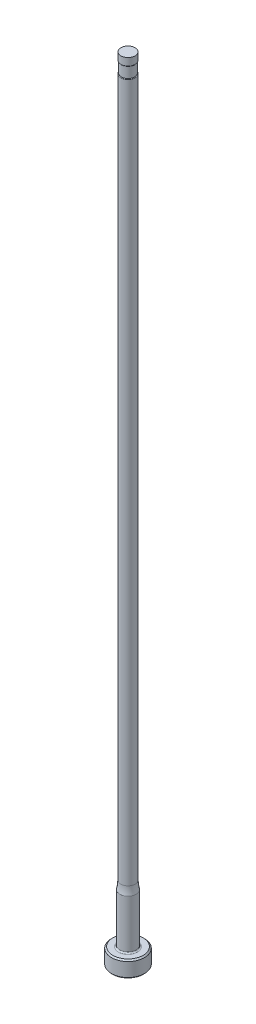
ISO-10303-21;
HEADER;
FILE_DESCRIPTION(('STEP AP214'),'2;1');
FILE_NAME('part.step','',(''),(''),'','','');
FILE_SCHEMA(('AUTOMOTIVE_DESIGN { 1 0 10303 214 1 1 1 1 }'));
ENDSEC;
DATA;
#1=APPLICATION_CONTEXT('core data for automotive mechanical design processes');
#2=APPLICATION_PROTOCOL_DEFINITION('international standard','automotive_design',2000,#1);
#3=PRODUCT_CONTEXT('',#1,'mechanical');
#4=PRODUCT('Part','Part','',(#3));
#5=PRODUCT_RELATED_PRODUCT_CATEGORY('part','',(#4));
#6=PRODUCT_DEFINITION_FORMATION('','',#4);
#7=PRODUCT_DEFINITION_CONTEXT('part definition',#1,'design');
#8=PRODUCT_DEFINITION('design','',#6,#7);
#9=PRODUCT_DEFINITION_SHAPE('','',#8);
#10=(LENGTH_UNIT() NAMED_UNIT(*) SI_UNIT(.MILLI.,.METRE.));
#11=(NAMED_UNIT(*) PLANE_ANGLE_UNIT() SI_UNIT($,.RADIAN.));
#12=(NAMED_UNIT(*) SI_UNIT($,.STERADIAN.) SOLID_ANGLE_UNIT());
#13=UNCERTAINTY_MEASURE_WITH_UNIT(LENGTH_MEASURE(1.E-05),#10,'distance_accuracy_value','');
#14=(GEOMETRIC_REPRESENTATION_CONTEXT(3) GLOBAL_UNCERTAINTY_ASSIGNED_CONTEXT((#13)) GLOBAL_UNIT_ASSIGNED_CONTEXT((#10,
#11,#12)) REPRESENTATION_CONTEXT('',''));
#15=CARTESIAN_POINT('',(0.,0.,0.));
#16=DIRECTION('',(0.,0.,1.));
#17=DIRECTION('',(1.,0.,0.));
#18=AXIS2_PLACEMENT_3D('',#15,#16,#17);
#19=CARTESIAN_POINT('',(0.,259.958771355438,0.));
#20=DIRECTION('',(0.,1.,0.));
#21=DIRECTION('',(0.,0.,1.));
#22=AXIS2_PLACEMENT_3D('',#19,#20,#21);
#23=CYLINDRICAL_SURFACE('',#22,1.38810999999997);
#24=DIRECTION('',(0.,1.,0.));
#25=VECTOR('',#24,1.);
#26=CARTESIAN_POINT('',(-1.28650999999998,259.958771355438,-0.521288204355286));
#27=LINE('',#26,#25);
#28=CARTESIAN_POINT('',(-1.28650999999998,148.719565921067,-0.521288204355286));
#29=VERTEX_POINT('',#28);
#30=CARTESIAN_POINT('',(-1.28650999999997,111.76,-0.521288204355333));
#31=VERTEX_POINT('',#30);
#32=EDGE_CURVE('E66',#29,#31,#27,.F.);
#33=ORIENTED_EDGE('',*,*,#32,.F.);
#34=CARTESIAN_POINT('',(0.,148.719565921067,0.));
#35=DIRECTION('',(0.,1.,0.));
#36=DIRECTION('',(0.,0.,1.));
#37=AXIS2_PLACEMENT_3D('',#34,#35,#36);
#38=CIRCLE('',#37,1.38810999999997);
#39=CARTESIAN_POINT('',(-1.28650999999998,148.719565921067,0.521288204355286));
#40=VERTEX_POINT('',#39);
#41=EDGE_CURVE('E44',#29,#40,#38,.F.);
#42=ORIENTED_EDGE('',*,*,#41,.T.);
#43=DIRECTION('',(0.,1.,0.));
#44=VECTOR('',#43,1.);
#45=CARTESIAN_POINT('',(-1.28650999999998,259.958771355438,0.521288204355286));
#46=LINE('',#45,#44);
#47=CARTESIAN_POINT('',(-1.28650999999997,111.76,0.521288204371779));
#48=VERTEX_POINT('',#47);
#49=EDGE_CURVE('E72',#48,#40,#46,.T.);
#50=ORIENTED_EDGE('',*,*,#49,.F.);
#51=CARTESIAN_POINT('',(-1.28650999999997,111.76,-0.521288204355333));
#52=CARTESIAN_POINT('',(-1.28650942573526,111.734928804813,-0.521284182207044));
#53=CARTESIAN_POINT('',(-1.28680726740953,111.709865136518,-0.520555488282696));
#54=CARTESIAN_POINT('',(-1.28799191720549,111.659826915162,-0.517619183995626));
#55=CARTESIAN_POINT('',(-1.28887900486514,111.634852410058,-0.515410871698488));
#56=CARTESIAN_POINT('',(-1.29243982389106,111.559619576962,-0.506452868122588));
#57=CARTESIAN_POINT('',(-1.29601290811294,111.509650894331,-0.49736839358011));
#58=CARTESIAN_POINT('',(-1.30530992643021,111.411479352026,-0.472434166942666));
#59=CARTESIAN_POINT('',(-1.31103961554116,111.363281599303,-0.456566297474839));
#60=CARTESIAN_POINT('',(-1.32412375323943,111.270513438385,-0.417110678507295));
#61=CARTESIAN_POINT('',(-1.33146964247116,111.225925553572,-0.393563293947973));
#62=CARTESIAN_POINT('',(-1.34350828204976,111.160593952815,-0.349438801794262));
#63=CARTESIAN_POINT('',(-1.34799903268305,111.137780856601,-0.331865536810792));
#64=CARTESIAN_POINT('',(-1.35686421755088,111.09496367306,-0.293524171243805));
#65=CARTESIAN_POINT('',(-1.36123876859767,111.074956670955,-0.272759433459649));
#66=CARTESIAN_POINT('',(-1.36869665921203,111.042112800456,-0.23208499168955));
#67=CARTESIAN_POINT('',(-1.37186978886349,111.028633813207,-0.212714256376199));
#68=CARTESIAN_POINT('',(-1.37757131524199,111.00495318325,-0.171955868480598));
#69=CARTESIAN_POINT('',(-1.38010004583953,110.994749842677,-0.150569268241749));
#70=CARTESIAN_POINT('',(-1.38424028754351,110.978264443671,-0.105984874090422));
#71=CARTESIAN_POINT('',(-1.38584269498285,110.972021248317,-0.0827715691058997));
#72=CARTESIAN_POINT('',(-1.3878558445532,110.964203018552,-0.0355242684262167));
#73=CARTESIAN_POINT('',(-1.38826785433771,110.962623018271,-0.0114911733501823));
#74=CARTESIAN_POINT('',(-1.38787374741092,110.964145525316,0.0326639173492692));
#75=CARTESIAN_POINT('',(-1.38724652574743,110.966560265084,0.0528147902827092));
#76=CARTESIAN_POINT('',(-1.38517272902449,110.974639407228,0.0924056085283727));
#77=CARTESIAN_POINT('',(-1.38372605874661,110.980304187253,0.111845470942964));
#78=CARTESIAN_POINT('',(-1.38015682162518,110.994532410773,0.149590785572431));
#79=CARTESIAN_POINT('',(-1.37803307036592,111.003100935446,0.167894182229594));
#80=CARTESIAN_POINT('',(-1.37329208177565,111.022682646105,0.203060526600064));
#81=CARTESIAN_POINT('',(-1.3706746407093,111.033696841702,0.219922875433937));
#82=CARTESIAN_POINT('',(-1.36363743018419,111.064179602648,0.260714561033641));
#83=CARTESIAN_POINT('',(-1.35900359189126,111.085015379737,0.283587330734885));
#84=CARTESIAN_POINT('',(-1.34954115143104,111.130071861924,0.325660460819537));
#85=CARTESIAN_POINT('',(-1.34471211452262,111.154300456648,0.344852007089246));
#86=CARTESIAN_POINT('',(-1.3331073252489,111.216742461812,0.387781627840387));
#87=CARTESIAN_POINT('',(-1.32644843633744,111.256293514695,0.409600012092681));
#88=CARTESIAN_POINT('',(-1.31433631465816,111.338492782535,0.446935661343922));
#89=CARTESIAN_POINT('',(-1.3088875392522,111.381151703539,0.462429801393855));
#90=CARTESIAN_POINT('',(-1.29848168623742,111.479173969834,0.491004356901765));
#91=CARTESIAN_POINT('',(-1.29398787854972,111.535047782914,0.50251359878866));
#92=CARTESIAN_POINT('',(-1.2895011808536,111.619377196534,0.513856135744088));
#93=CARTESIAN_POINT('',(-1.28838136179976,111.647428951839,0.516650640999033));
#94=CARTESIAN_POINT('',(-1.28688584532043,111.703649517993,0.520362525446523));
#95=CARTESIAN_POINT('',(-1.28650943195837,111.731818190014,0.521281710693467));
#96=CARTESIAN_POINT('',(-1.28650999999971,111.759999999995,0.521288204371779));
#97=B_SPLINE_CURVE_WITH_KNOTS('',3,(#51,#52,#53,#54,#55,#56,#57,#58,#59,#60,#61,#62,#63,#64,#65,
#66,#67,#68,#69,#70,#71,#72,#73,#74,#75,#76,#77,#78,#79,#80,#81,#82,#83,#84,#85,#86,#87,#88,#89,
#90,#91,#92,#93,#94,#95,#96),.UNSPECIFIED.,.F.,.F.,(4,2,2,2,2,2,2,2,2,2,2,2,2,2,2,2,2,2,2,2,2,2,
4),(0.,0.0751855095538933,0.15040671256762,0.30263293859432,0.455268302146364,0.607113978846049,
0.694309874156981,0.781414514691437,0.852578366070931,0.923705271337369,0.995519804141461,
1.06725783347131,1.12787752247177,1.18850425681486,1.2492376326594,1.30999612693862,
1.40332110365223,1.49686681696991,1.63308593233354,1.76979877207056,1.94068119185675,
2.02526314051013,2.10976359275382),.UNSPECIFIED.);
#98=EDGE_CURVE('E74',#31,#48,#97,.T.);
#99=ORIENTED_EDGE('',*,*,#98,.F.);
#100=EDGE_LOOP('',(#33,#42,#50,#99));
#101=FACE_BOUND('',#100,.T.);
#102=CARTESIAN_POINT('',(0.,14.2787642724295,0.));
#103=DIRECTION('',(0.,1.,0.));
#104=DIRECTION('',(0.,0.,1.));
#105=AXIS2_PLACEMENT_3D('',#102,#103,#104);
#106=CIRCLE('',#105,1.38810999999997);
#107=CARTESIAN_POINT('',(0.,14.2787642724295,1.38810999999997));
#108=VERTEX_POINT('',#107);
#109=EDGE_CURVE('E95',#108,#108,#106,.T.);
#110=ORIENTED_EDGE('',*,*,#109,.T.);
#111=EDGE_LOOP('',(#110));
#112=FACE_BOUND('',#111,.T.);
#113=ADVANCED_FACE('F36',(#101,#112),#23,.T.);
#114=CARTESIAN_POINT('',(0.,14.2787642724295,0.));
#115=DIRECTION('',(0.,1.,0.));
#116=DIRECTION('',(0.,0.,1.));
#117=AXIS2_PLACEMENT_3D('',#114,#115,#116);
#118=TOROIDAL_SURFACE('',#117,7.73810999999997,6.35);
#119=CARTESIAN_POINT('',(0.,12.7,0.));
#120=DIRECTION('',(0.,1.,0.));
#121=DIRECTION('',(0.,0.,1.));
#122=AXIS2_PLACEMENT_3D('',#119,#120,#121);
#123=CIRCLE('',#122,1.58749999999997);
#124=CARTESIAN_POINT('',(0.,12.7,1.58749999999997));
#125=VERTEX_POINT('',#124);
#126=EDGE_CURVE('E92',#125,#125,#123,.T.);
#127=ORIENTED_EDGE('',*,*,#126,.T.);
#128=EDGE_LOOP('',(#127));
#129=FACE_BOUND('',#128,.T.);
#130=ORIENTED_EDGE('',*,*,#109,.F.);
#131=EDGE_LOOP('',(#130));
#132=FACE_BOUND('',#131,.T.);
#133=ADVANCED_FACE('F156',(#129,#132),#118,.F.);
#134=CARTESIAN_POINT('',(0.,259.958771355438,0.));
#135=DIRECTION('',(0.,1.,0.));
#136=DIRECTION('',(0.,0.,1.));
#137=AXIS2_PLACEMENT_3D('',#134,#135,#136);
#138=CYLINDRICAL_SURFACE('',#137,1.58749999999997);
#139=CARTESIAN_POINT('',(0.,3.42900000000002,0.));
#140=DIRECTION('',(0.,1.,0.));
#141=DIRECTION('',(0.,0.,1.));
#142=AXIS2_PLACEMENT_3D('',#139,#140,#141);
#143=CIRCLE('',#142,1.58749999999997);
#144=CARTESIAN_POINT('',(0.,3.42900000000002,1.58749999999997));
#145=VERTEX_POINT('',#144);
#146=EDGE_CURVE('E110',#145,#145,#143,.T.);
#147=ORIENTED_EDGE('',*,*,#146,.T.);
#148=EDGE_LOOP('',(#147));
#149=FACE_BOUND('',#148,.T.);
#150=ORIENTED_EDGE('',*,*,#126,.F.);
#151=EDGE_LOOP('',(#150));
#152=FACE_BOUND('',#151,.T.);
#153=ADVANCED_FACE('F153',(#149,#152),#138,.T.);
#154=CARTESIAN_POINT('',(-3.17499999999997,3.175,0.));
#155=DIRECTION('',(0.,1.,0.));
#156=DIRECTION('',(0.,0.,1.));
#157=AXIS2_PLACEMENT_3D('',#154,#155,#156);
#158=PLANE('',#157);
#159=CARTESIAN_POINT('',(0.,3.175,0.));
#160=DIRECTION('',(0.,1.,0.));
#161=DIRECTION('',(0.,0.,1.));
#162=AXIS2_PLACEMENT_3D('',#159,#160,#161);
#163=CIRCLE('',#162,1.84149999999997);
#164=CARTESIAN_POINT('',(0.,3.175,1.84149999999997));
#165=VERTEX_POINT('',#164);
#166=EDGE_CURVE('E78',#165,#165,#163,.F.);
#167=ORIENTED_EDGE('',*,*,#166,.T.);
#168=EDGE_LOOP('',(#167));
#169=FACE_BOUND('',#168,.T.);
#170=CARTESIAN_POINT('',(0.,3.175,0.));
#171=DIRECTION('',(0.,1.,0.));
#172=DIRECTION('',(0.,0.,1.));
#173=AXIS2_PLACEMENT_3D('',#170,#171,#172);
#174=CIRCLE('',#173,2.92099999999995);
#175=CARTESIAN_POINT('',(0.,3.175,2.92099999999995));
#176=VERTEX_POINT('',#175);
#177=EDGE_CURVE('E98',#176,#176,#174,.T.);
#178=ORIENTED_EDGE('',*,*,#177,.T.);
#179=EDGE_LOOP('',(#178));
#180=FACE_BOUND('',#179,.T.);
#181=ADVANCED_FACE('F149',(#169,#180),#158,.T.);
#182=CARTESIAN_POINT('',(0.,259.958771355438,0.));
#183=DIRECTION('',(0.,1.,0.));
#184=DIRECTION('',(0.,0.,1.));
#185=AXIS2_PLACEMENT_3D('',#182,#183,#184);
#186=CYLINDRICAL_SURFACE('',#185,3.17499999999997);
#187=CARTESIAN_POINT('',(0.,2.92100000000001,0.));
#188=DIRECTION('',(0.,1.,0.));
#189=DIRECTION('',(0.,0.,1.));
#190=AXIS2_PLACEMENT_3D('',#187,#188,#189);
#191=CIRCLE('',#190,3.17499999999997);
#192=CARTESIAN_POINT('',(0.,2.92100000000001,3.17499999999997));
#193=VERTEX_POINT('',#192);
#194=EDGE_CURVE('E104',#193,#193,#191,.F.);
#195=ORIENTED_EDGE('',*,*,#194,.T.);
#196=EDGE_LOOP('',(#195));
#197=FACE_BOUND('',#196,.T.);
#198=CARTESIAN_POINT('',(0.,0.254000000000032,0.));
#199=DIRECTION('',(0.,-1.,0.));
#200=DIRECTION('',(0.,0.,-1.));
#201=AXIS2_PLACEMENT_3D('',#198,#199,#200);
#202=CIRCLE('',#201,3.17499999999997);
#203=CARTESIAN_POINT('',(0.,0.254000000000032,-3.17499999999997));
#204=VERTEX_POINT('',#203);
#205=EDGE_CURVE('E101',#204,#204,#202,.F.);
#206=ORIENTED_EDGE('',*,*,#205,.T.);
#207=EDGE_LOOP('',(#206));
#208=FACE_BOUND('',#207,.T.);
#209=ADVANCED_FACE('F145',(#197,#208),#186,.T.);
#210=CARTESIAN_POINT('',(0.,0.,0.));
#211=DIRECTION('',(0.,-1.,0.));
#212=DIRECTION('',(0.,0.,-1.));
#213=AXIS2_PLACEMENT_3D('',#210,#211,#212);
#214=PLANE('',#213);
#215=CARTESIAN_POINT('',(0.,0.,0.));
#216=DIRECTION('',(0.,-1.,0.));
#217=DIRECTION('',(0.,0.,-1.));
#218=AXIS2_PLACEMENT_3D('',#215,#216,#217);
#219=CIRCLE('',#218,2.92099999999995);
#220=CARTESIAN_POINT('',(0.,0.,-2.92099999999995));
#221=VERTEX_POINT('',#220);
#222=EDGE_CURVE('E107',#221,#221,#219,.T.);
#223=ORIENTED_EDGE('',*,*,#222,.T.);
#224=EDGE_LOOP('',(#223));
#225=FACE_BOUND('',#224,.T.);
#226=ADVANCED_FACE('F141',(#225),#214,.T.);
#227=CARTESIAN_POINT('',(0.,3.17499999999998,0.));
#228=DIRECTION('',(0.,-1.,0.));
#229=DIRECTION('',(0.,0.,-1.));
#230=AXIS2_PLACEMENT_3D('',#227,#228,#229);
#231=CONICAL_SURFACE('',#230,2.92099999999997,0.7853981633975);
#232=ORIENTED_EDGE('',*,*,#194,.F.);
#233=EDGE_LOOP('',(#232));
#234=FACE_BOUND('',#233,.T.);
#235=ORIENTED_EDGE('',*,*,#177,.F.);
#236=EDGE_LOOP('',(#235));
#237=FACE_BOUND('',#236,.T.);
#238=ADVANCED_FACE('F144',(#234,#237),#231,.T.);
#239=CARTESIAN_POINT('',(0.,0.254000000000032,0.));
#240=DIRECTION('',(0.,1.,0.));
#241=DIRECTION('',(0.,0.,1.));
#242=AXIS2_PLACEMENT_3D('',#239,#240,#241);
#243=CONICAL_SURFACE('',#242,3.17499999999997,0.785398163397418);
#244=ORIENTED_EDGE('',*,*,#222,.F.);
#245=EDGE_LOOP('',(#244));
#246=FACE_BOUND('',#245,.T.);
#247=ORIENTED_EDGE('',*,*,#205,.F.);
#248=EDGE_LOOP('',(#247));
#249=FACE_BOUND('',#248,.T.);
#250=ADVANCED_FACE('F245',(#246,#249),#243,.T.);
#251=CARTESIAN_POINT('',(0.,3.42900000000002,0.));
#252=DIRECTION('',(0.,1.,0.));
#253=DIRECTION('',(0.,0.,1.));
#254=AXIS2_PLACEMENT_3D('',#251,#252,#253);
#255=TOROIDAL_SURFACE('',#254,1.84149999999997,0.254);
#256=ORIENTED_EDGE('',*,*,#166,.F.);
#257=EDGE_LOOP('',(#256));
#258=FACE_BOUND('',#257,.T.);
#259=ORIENTED_EDGE('',*,*,#146,.F.);
#260=EDGE_LOOP('',(#259));
#261=FACE_BOUND('',#260,.T.);
#262=ADVANCED_FACE('F139',(#258,#261),#255,.F.);
#263=CARTESIAN_POINT('',(0.,153.448281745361,0.));
#264=DIRECTION('',(0.,1.,0.));
#265=DIRECTION('',(0.,0.,1.));
#266=AXIS2_PLACEMENT_3D('',#263,#264,#265);
#267=CYLINDRICAL_SURFACE('',#266,1.28650999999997);
#268=CARTESIAN_POINT('',(0.,150.876,0.));
#269=DIRECTION('',(0.,1.,0.));
#270=DIRECTION('',(0.,0.,1.));
#271=AXIS2_PLACEMENT_3D('',#268,#269,#270);
#272=CIRCLE('',#271,1.28650999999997);
#273=CARTESIAN_POINT('',(0.,150.876,1.28650999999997));
#274=VERTEX_POINT('',#273);
#275=EDGE_CURVE('E71',#274,#274,#272,.T.);
#276=ORIENTED_EDGE('',*,*,#275,.F.);
#277=EDGE_LOOP('',(#276));
#278=FACE_BOUND('',#277,.T.);
#279=CARTESIAN_POINT('',(0.,148.844,0.));
#280=DIRECTION('',(0.,1.,0.));
#281=DIRECTION('',(0.,0.,1.));
#282=AXIS2_PLACEMENT_3D('',#279,#280,#281);
#283=CIRCLE('',#282,1.28650999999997);
#284=CARTESIAN_POINT('',(-1.28650999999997,148.844,0.));
#285=VERTEX_POINT('',#284);
#286=EDGE_CURVE('E89',#285,#285,#283,.T.);
#287=ORIENTED_EDGE('',*,*,#286,.T.);
#288=EDGE_LOOP('',(#287));
#289=FACE_BOUND('',#288,.T.);
#290=ADVANCED_FACE('F136',(#278,#289),#267,.T.);
#291=CARTESIAN_POINT('',(-1.28650999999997,149.86,-3.17499999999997));
#292=DIRECTION('',(1.,0.,0.));
#293=DIRECTION('',(0.,1.,0.));
#294=AXIS2_PLACEMENT_3D('',#291,#292,#293);
#295=PLANE('',#294);
#296=CARTESIAN_POINT('',(-1.28650999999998,148.719565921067,0.521288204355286));
#297=CARTESIAN_POINT('',(-1.28650999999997,148.722543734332,0.521296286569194));
#298=CARTESIAN_POINT('',(-1.28650999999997,148.72551092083,0.52100974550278));
#299=CARTESIAN_POINT('',(-1.28650999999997,148.731314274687,0.519922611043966));
#300=CARTESIAN_POINT('',(-1.28650999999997,148.734151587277,0.519128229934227));
#301=CARTESIAN_POINT('',(-1.28650999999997,148.74028840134,0.516865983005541));
#302=CARTESIAN_POINT('',(-1.28650999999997,148.743545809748,0.515285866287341));
#303=CARTESIAN_POINT('',(-1.28650999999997,148.749773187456,0.511618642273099));
#304=CARTESIAN_POINT('',(-1.28650999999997,148.75274164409,0.509529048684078));
#305=CARTESIAN_POINT('',(-1.28650999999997,148.760061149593,0.503633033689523));
#306=CARTESIAN_POINT('',(-1.28650999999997,148.764183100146,0.499545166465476));
#307=CARTESIAN_POINT('',(-1.28650999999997,148.771782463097,0.490820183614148));
#308=CARTESIAN_POINT('',(-1.28650999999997,148.775258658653,0.486182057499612));
#309=CARTESIAN_POINT('',(-1.28650999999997,148.785007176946,0.471627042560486));
#310=CARTESIAN_POINT('',(-1.28650999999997,148.790482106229,0.461183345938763));
#311=CARTESIAN_POINT('',(-1.28650999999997,148.800043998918,0.43969024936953));
#312=CARTESIAN_POINT('',(-1.28650999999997,148.804126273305,0.42863894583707));
#313=CARTESIAN_POINT('',(-1.28650999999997,148.81162285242,0.405219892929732));
#314=CARTESIAN_POINT('',(-1.28650999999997,148.814944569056,0.392822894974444));
#315=CARTESIAN_POINT('',(-1.28650999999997,148.820742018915,0.367829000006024));
#316=CARTESIAN_POINT('',(-1.28650999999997,148.823216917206,0.355231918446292));
#317=CARTESIAN_POINT('',(-1.28650999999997,148.829717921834,0.317205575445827));
#318=CARTESIAN_POINT('',(-1.28650999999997,148.832799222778,0.291618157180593));
#319=CARTESIAN_POINT('',(-1.28650999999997,148.83753097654,0.240181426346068));
#320=CARTESIAN_POINT('',(-1.28650999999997,148.839172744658,0.214331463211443));
#321=CARTESIAN_POINT('',(-1.28650999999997,148.841602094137,0.162584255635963));
#322=CARTESIAN_POINT('',(-1.28650999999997,148.842389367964,0.13668699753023));
#323=CARTESIAN_POINT('',(-1.28650999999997,148.843321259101,0.0922416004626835));
#324=CARTESIAN_POINT('',(-1.28650999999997,148.843584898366,0.0736953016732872));
#325=CARTESIAN_POINT('',(-1.28650999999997,148.843919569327,0.0367659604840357));
#326=CARTESIAN_POINT('',(-1.28650999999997,148.843992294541,0.018382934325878));
#327=CARTESIAN_POINT('',(-1.28650999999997,148.844,0.));
#328=B_SPLINE_CURVE_WITH_KNOTS('',3,(#296,#297,#298,#299,#300,#301,#302,#303,#304,#305,#306,
#307,#308,#309,#310,#311,#312,#313,#314,#315,#316,#317,#318,#319,#320,#321,#322,#323,#324,#325,
#326,#327),.UNSPECIFIED.,.F.,.F.,(4,2,2,2,2,2,2,2,2,2,2,2,2,2,2,4),(0.,0.0089025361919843,
0.0176982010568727,0.0284990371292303,0.039353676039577,0.0566710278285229,0.0740206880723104,
0.109198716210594,0.144494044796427,0.182950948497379,0.22144566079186,0.298673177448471,
0.376363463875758,0.454081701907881,0.509725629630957,0.564874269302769),.UNSPECIFIED.);
#329=EDGE_CURVE('E77',#40,#285,#328,.T.);
#330=ORIENTED_EDGE('',*,*,#329,.T.);
#331=CARTESIAN_POINT('',(-1.28650999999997,148.844,0.));
#332=CARTESIAN_POINT('',(-1.28650999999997,148.843985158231,-0.0211574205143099));
#333=CARTESIAN_POINT('',(-1.28650999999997,148.843892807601,-0.042316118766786));
#334=CARTESIAN_POINT('',(-1.28650999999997,148.843447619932,-0.0846465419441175));
#335=CARTESIAN_POINT('',(-1.28650999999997,148.843094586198,-0.105818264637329));
#336=CARTESIAN_POINT('',(-1.28650999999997,148.842021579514,-0.148180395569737));
#337=CARTESIAN_POINT('',(-1.28650999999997,148.841301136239,-0.169370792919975));
#338=CARTESIAN_POINT('',(-1.28650999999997,148.839275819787,-0.211719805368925));
#339=CARTESIAN_POINT('',(-1.28650999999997,148.837971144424,-0.23287842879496));
#340=CARTESIAN_POINT('',(-1.28650999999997,148.834936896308,-0.2692392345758));
#341=CARTESIAN_POINT('',(-1.28650999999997,148.833426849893,-0.284459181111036));
#342=CARTESIAN_POINT('',(-1.28650999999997,148.829747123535,-0.314836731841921));
#343=CARTESIAN_POINT('',(-1.28650999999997,148.827576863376,-0.329994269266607));
#344=CARTESIAN_POINT('',(-1.28650999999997,148.822226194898,-0.360706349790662));
#345=CARTESIAN_POINT('',(-1.28650999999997,148.819011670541,-0.376255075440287));
#346=CARTESIAN_POINT('',(-1.28650999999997,148.811175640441,-0.406994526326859));
#347=CARTESIAN_POINT('',(-1.28650999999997,148.806556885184,-0.422185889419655));
#348=CARTESIAN_POINT('',(-1.28650999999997,148.798067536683,-0.444158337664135));
#349=CARTESIAN_POINT('',(-1.28650999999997,148.795027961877,-0.451257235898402));
#350=CARTESIAN_POINT('',(-1.28650999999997,148.788272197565,-0.465143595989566));
#351=CARTESIAN_POINT('',(-1.28650999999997,148.784555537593,-0.471930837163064));
#352=CARTESIAN_POINT('',(-1.28650999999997,148.777166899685,-0.483496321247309));
#353=CARTESIAN_POINT('',(-1.28650999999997,148.773669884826,-0.488384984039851));
#354=CARTESIAN_POINT('',(-1.28650999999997,148.766009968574,-0.497611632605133));
#355=CARTESIAN_POINT('',(-1.28650999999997,148.76184924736,-0.501951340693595));
#356=CARTESIAN_POINT('',(-1.28650999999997,148.754744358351,-0.507990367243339));
#357=CARTESIAN_POINT('',(-1.28650999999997,148.752073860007,-0.510009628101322));
#358=CARTESIAN_POINT('',(-1.28650999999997,148.746472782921,-0.513654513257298));
#359=CARTESIAN_POINT('',(-1.28650999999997,148.743542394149,-0.515280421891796));
#360=CARTESIAN_POINT('',(-1.28650999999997,148.737862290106,-0.517827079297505));
#361=CARTESIAN_POINT('',(-1.28650999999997,148.735142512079,-0.518813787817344));
#362=CARTESIAN_POINT('',(-1.28650999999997,148.729578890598,-0.520316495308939));
#363=CARTESIAN_POINT('',(-1.28650999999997,148.726735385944,-0.520833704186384));
#364=CARTESIAN_POINT('',(-1.28650999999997,148.722439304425,-0.521223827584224));
#365=CARTESIAN_POINT('',(-1.28650999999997,148.721002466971,-0.52128961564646));
#366=CARTESIAN_POINT('',(-1.28650999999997,148.719565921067,-0.521288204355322));
#367=B_SPLINE_CURVE_WITH_KNOTS('',3,(#331,#332,#333,#334,#335,#336,#337,#338,#339,#340,#341,
#342,#343,#344,#345,#346,#347,#348,#349,#350,#351,#352,#353,#354,#355,#356,#357,#358,#359,#360,
#361,#362,#363,#364,#365,#366),.UNSPECIFIED.,.F.,.F.,(4,2,2,2,2,2,2,2,2,2,2,2,2,2,2,2,2,4),(0.,
0.0634741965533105,0.126996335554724,0.190599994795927,0.254182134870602,0.300056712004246,
0.345971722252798,0.393570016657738,0.441075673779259,0.464219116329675,0.487378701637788,
0.505372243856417,0.523307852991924,0.533326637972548,0.54333815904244,0.551983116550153,
0.560605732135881,0.564915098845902),.UNSPECIFIED.);
#368=EDGE_CURVE('E58',#285,#29,#367,.T.);
#369=ORIENTED_EDGE('',*,*,#368,.T.);
#370=ORIENTED_EDGE('',*,*,#32,.T.);
#371=DIRECTION('',(0.,0.,1.));
#372=VECTOR('',#371,1.);
#373=CARTESIAN_POINT('',(-1.28650999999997,111.76,-3.17499999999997));
#374=LINE('',#373,#372);
#375=EDGE_CURVE('E70',#31,#48,#374,.T.);
#376=ORIENTED_EDGE('',*,*,#375,.T.);
#377=ORIENTED_EDGE('',*,*,#49,.T.);
#378=EDGE_LOOP('',(#330,#369,#370,#376,#377));
#379=FACE_BOUND('',#378,.T.);
#380=ADVANCED_FACE('F68',(#379),#295,.F.);
#381=CARTESIAN_POINT('',(-4.46150999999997,111.76,-3.17499999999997));
#382=DIRECTION('',(0.,0.,1.));
#383=DIRECTION('',(1.,0.,0.));
#384=AXIS2_PLACEMENT_3D('',#381,#382,#383);
#385=CYLINDRICAL_SURFACE('',#384,3.175);
#386=ORIENTED_EDGE('',*,*,#375,.F.);
#387=ORIENTED_EDGE('',*,*,#98,.T.);
#388=EDGE_LOOP('',(#386,#387));
#389=FACE_BOUND('',#388,.T.);
#390=ADVANCED_FACE('F80',(#389),#385,.F.);
#391=CARTESIAN_POINT('',(0.,152.687735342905,0.));
#392=DIRECTION('',(0.,1.,0.));
#393=DIRECTION('',(0.,0.,1.));
#394=AXIS2_PLACEMENT_3D('',#391,#392,#393);
#395=CYLINDRICAL_SURFACE('',#394,1.36270999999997);
#396=CARTESIAN_POINT('',(0.,150.992397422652,0.));
#397=DIRECTION('',(0.,-1.,0.));
#398=DIRECTION('',(0.,0.,-1.));
#399=AXIS2_PLACEMENT_3D('',#396,#397,#398);
#400=CIRCLE('',#399,1.36270999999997);
#401=CARTESIAN_POINT('',(0.,150.992397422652,-1.36270999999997));
#402=VERTEX_POINT('',#401);
#403=EDGE_CURVE('E11',#402,#402,#400,.F.);
#404=ORIENTED_EDGE('',*,*,#403,.T.);
#405=EDGE_LOOP('',(#404));
#406=FACE_BOUND('',#405,.T.);
#407=CARTESIAN_POINT('',(0.,152.4,0.));
#408=DIRECTION('',(0.,1.,0.));
#409=DIRECTION('',(0.,0.,1.));
#410=AXIS2_PLACEMENT_3D('',#407,#408,#409);
#411=CIRCLE('',#410,1.36270999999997);
#412=CARTESIAN_POINT('',(0.,152.4,1.36270999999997));
#413=VERTEX_POINT('',#412);
#414=EDGE_CURVE('E81',#413,#413,#411,.T.);
#415=ORIENTED_EDGE('',*,*,#414,.F.);
#416=EDGE_LOOP('',(#415));
#417=FACE_BOUND('',#416,.T.);
#418=ADVANCED_FACE('F133',(#406,#417),#395,.T.);
#419=CARTESIAN_POINT('',(-1.38810999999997,152.4,0.));
#420=DIRECTION('',(0.,1.,0.));
#421=DIRECTION('',(0.,0.,1.));
#422=AXIS2_PLACEMENT_3D('',#419,#420,#421);
#423=PLANE('',#422);
#424=ORIENTED_EDGE('',*,*,#414,.T.);
#425=EDGE_LOOP('',(#424));
#426=FACE_BOUND('',#425,.T.);
#427=ADVANCED_FACE('F177',(#426),#423,.T.);
#428=CARTESIAN_POINT('',(0.,148.719565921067,0.));
#429=DIRECTION('',(0.,1.,0.));
#430=DIRECTION('',(0.,0.,1.));
#431=AXIS2_PLACEMENT_3D('',#428,#429,#430);
#432=TOROIDAL_SURFACE('',#431,1.26110999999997,0.127);
#433=ORIENTED_EDGE('',*,*,#329,.F.);
#434=ORIENTED_EDGE('',*,*,#41,.F.);
#435=ORIENTED_EDGE('',*,*,#368,.F.);
#436=ORIENTED_EDGE('',*,*,#286,.F.);
#437=EDGE_LOOP('',(#433,#434,#435,#436));
#438=FACE_BOUND('',#437,.T.);
#439=ADVANCED_FACE('F209',(#438),#432,.T.);
#440=CARTESIAN_POINT('',(0.,150.992397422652,0.));
#441=DIRECTION('',(0.,-1.,0.));
#442=DIRECTION('',(0.,0.,-1.));
#443=AXIS2_PLACEMENT_3D('',#440,#441,#442);
#444=TOROIDAL_SURFACE('',#443,1.23570999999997,0.127);
#445=ORIENTED_EDGE('',*,*,#275,.T.);
#446=EDGE_LOOP('',(#445));
#447=FACE_BOUND('',#446,.T.);
#448=ORIENTED_EDGE('',*,*,#403,.F.);
#449=EDGE_LOOP('',(#448));
#450=FACE_BOUND('',#449,.T.);
#451=ADVANCED_FACE('F38',(#447,#450),#444,.T.);
#452=CLOSED_SHELL('',(#113,#133,#153,#181,#209,#226,#238,#250,#262,#290,#380,#390,#418,#427,
#439,#451));
#453=MANIFOLD_SOLID_BREP('B2',#452);
#454=ADVANCED_BREP_SHAPE_REPRESENTATION('',(#18,#453),#14);
#455=SHAPE_DEFINITION_REPRESENTATION(#9,#454);
ENDSEC;
END-ISO-10303-21;
